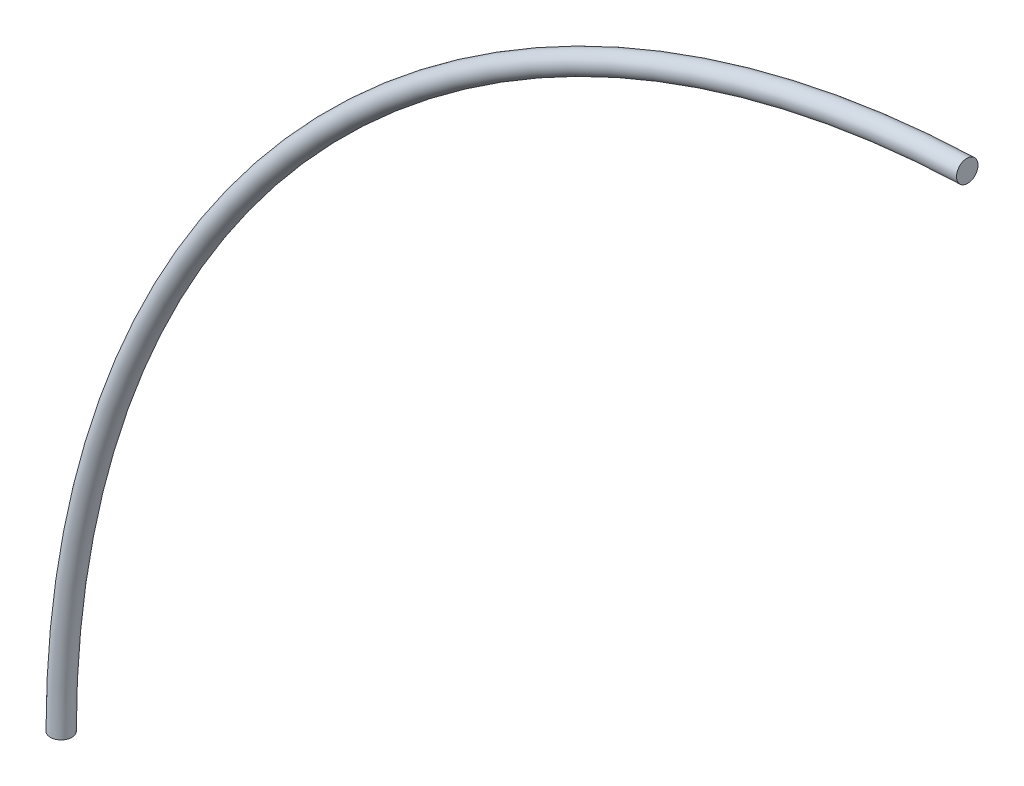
ISO-10303-21;
HEADER;
FILE_DESCRIPTION(('STEP AP214'),'2;1');
FILE_NAME('part.step','',(''),(''),'','','');
FILE_SCHEMA(('AUTOMOTIVE_DESIGN { 1 0 10303 214 1 1 1 1 }'));
ENDSEC;
DATA;
#1=APPLICATION_CONTEXT('core data for automotive mechanical design processes');
#2=APPLICATION_PROTOCOL_DEFINITION('international standard','automotive_design',2000,#1);
#3=PRODUCT_CONTEXT('',#1,'mechanical');
#4=PRODUCT('Part','Part','',(#3));
#5=PRODUCT_RELATED_PRODUCT_CATEGORY('part','',(#4));
#6=PRODUCT_DEFINITION_FORMATION('','',#4);
#7=PRODUCT_DEFINITION_CONTEXT('part definition',#1,'design');
#8=PRODUCT_DEFINITION('design','',#6,#7);
#9=PRODUCT_DEFINITION_SHAPE('','',#8);
#10=(LENGTH_UNIT() NAMED_UNIT(*) SI_UNIT(.MILLI.,.METRE.));
#11=(NAMED_UNIT(*) PLANE_ANGLE_UNIT() SI_UNIT($,.RADIAN.));
#12=(NAMED_UNIT(*) SI_UNIT($,.STERADIAN.) SOLID_ANGLE_UNIT());
#13=UNCERTAINTY_MEASURE_WITH_UNIT(LENGTH_MEASURE(1.E-05),#10,'distance_accuracy_value','');
#14=(GEOMETRIC_REPRESENTATION_CONTEXT(3) GLOBAL_UNCERTAINTY_ASSIGNED_CONTEXT((#13)) GLOBAL_UNIT_ASSIGNED_CONTEXT((#10,
#11,#12)) REPRESENTATION_CONTEXT('',''));
#15=CARTESIAN_POINT('',(0.,0.,0.));
#16=DIRECTION('',(0.,0.,1.));
#17=DIRECTION('',(1.,0.,0.));
#18=AXIS2_PLACEMENT_3D('',#15,#16,#17);
#19=CARTESIAN_POINT('',(-347.373527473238,0.,0.));
#20=DIRECTION('',(0.,1.,0.));
#21=DIRECTION('',(0.,0.,1.));
#22=AXIS2_PLACEMENT_3D('',#19,#20,#21);
#23=PLANE('',#22);
#24=CARTESIAN_POINT('',(-347.373527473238,0.,0.));
#25=DIRECTION('',(0.,1.,0.));
#26=DIRECTION('',(0.,0.,1.));
#27=AXIS2_PLACEMENT_3D('',#24,#25,#26);
#28=CIRCLE('',#27,3.96875000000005);
#29=CARTESIAN_POINT('',(-351.342277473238,0.,0.));
#30=VERTEX_POINT('',#29);
#31=EDGE_CURVE('E37',#30,#30,#28,.T.);
#32=ORIENTED_EDGE('',*,*,#31,.F.);
#33=EDGE_LOOP('',(#32));
#34=FACE_BOUND('',#33,.T.);
#35=ADVANCED_FACE('F31',(#34),#23,.F.);
#36=CARTESIAN_POINT('',(-12.1396343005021,347.161341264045,0.));
#37=DIRECTION('',(0.999389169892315,0.0349469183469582,0.));
#38=DIRECTION('',(0.,0.,1.));
#39=AXIS2_PLACEMENT_3D('',#36,#37,#38);
#40=PLANE('',#39);
#41=CARTESIAN_POINT('',(-12.1396343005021,347.161341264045,0.));
#42=DIRECTION('',(0.999389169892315,0.0349469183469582,0.));
#43=DIRECTION('',(0.,0.,1.));
#44=AXIS2_PLACEMENT_3D('',#41,#42,#43);
#45=CIRCLE('',#44,3.96875000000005);
#46=CARTESIAN_POINT('',(-12.2783298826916,351.127667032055,0.));
#47=VERTEX_POINT('',#46);
#48=EDGE_CURVE('E10',#47,#47,#45,.T.);
#49=ORIENTED_EDGE('',*,*,#48,.T.);
#50=EDGE_LOOP('',(#49));
#51=FACE_BOUND('',#50,.T.);
#52=ADVANCED_FACE('F46',(#51),#40,.T.);
#53=CARTESIAN_POINT('',(0.,0.,0.));
#54=DIRECTION('',(0.,0.,-1.));
#55=DIRECTION('',(-1.,0.,0.));
#56=AXIS2_PLACEMENT_3D('',#53,#54,#55);
#57=TOROIDAL_SURFACE('',#56,347.373527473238,3.96875000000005);
#58=CARTESIAN_POINT('',(0.,0.,0.));
#59=DIRECTION('',(0.,0.,-1.));
#60=DIRECTION('',(-1.,0.,0.));
#61=AXIS2_PLACEMENT_3D('',#58,#59,#60);
#62=CIRCLE('',#61,351.342277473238);
#63=EDGE_CURVE('',#30,#47,#62,.T.);
#64=ORIENTED_EDGE('',*,*,#31,.T.);
#65=ORIENTED_EDGE('',*,*,#48,.F.);
#66=ORIENTED_EDGE('',*,*,#63,.T.);
#67=ORIENTED_EDGE('',*,*,#63,.F.);
#68=EDGE_LOOP('',(#64,#66,#65,#67));
#69=FACE_BOUND('',#68,.T.);
#70=ADVANCED_FACE('F43',(#69),#57,.T.);
#71=CLOSED_SHELL('',(#35,#52,#70));
#72=MANIFOLD_SOLID_BREP('B2',#71);
#73=ADVANCED_BREP_SHAPE_REPRESENTATION('',(#18,#72),#14);
#74=SHAPE_DEFINITION_REPRESENTATION(#9,#73);
ENDSEC;
END-ISO-10303-21;
